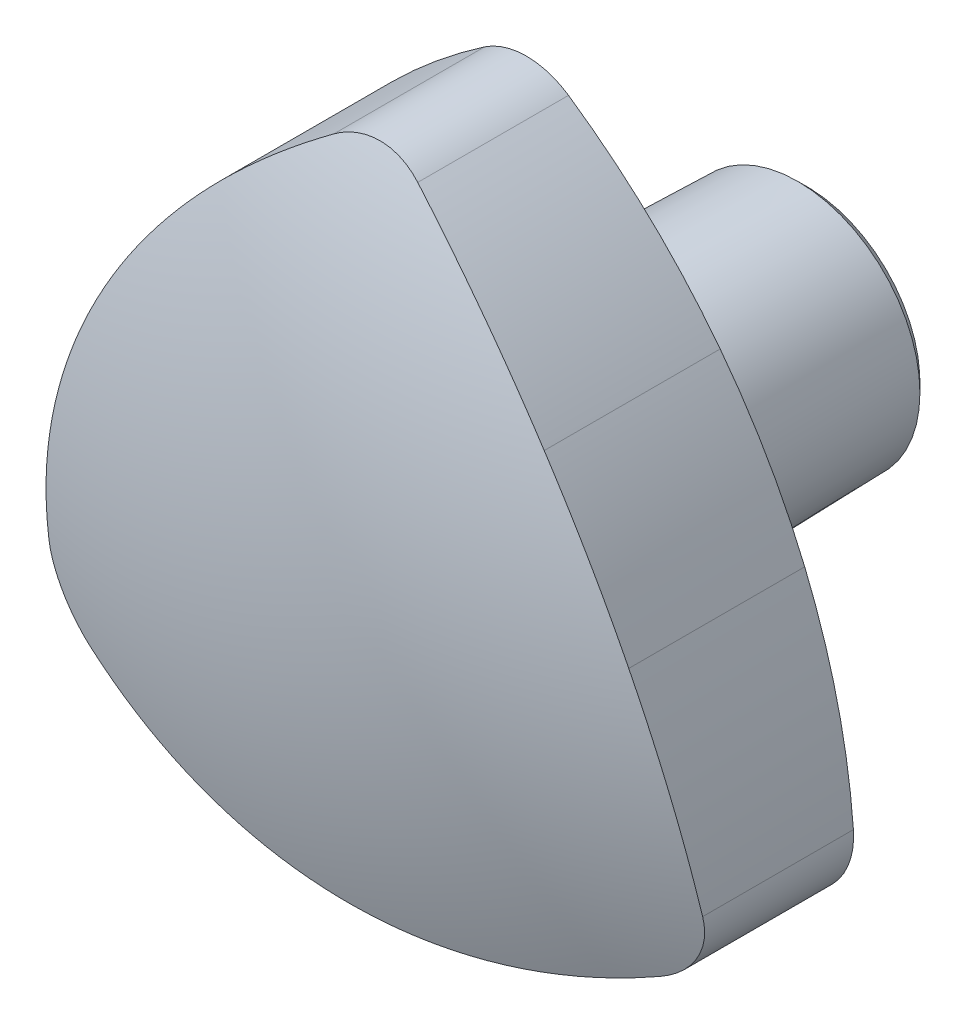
ISO-10303-21;
HEADER;
FILE_DESCRIPTION(('STEP AP214'),'2;1');
FILE_NAME('part.step','',(''),(''),'','','');
FILE_SCHEMA(('AUTOMOTIVE_DESIGN { 1 0 10303 214 1 1 1 1 }'));
ENDSEC;
DATA;
#1=APPLICATION_CONTEXT('core data for automotive mechanical design processes');
#2=APPLICATION_PROTOCOL_DEFINITION('international standard','automotive_design',2000,#1);
#3=PRODUCT_CONTEXT('',#1,'mechanical');
#4=PRODUCT('Part','Part','',(#3));
#5=PRODUCT_RELATED_PRODUCT_CATEGORY('part','',(#4));
#6=PRODUCT_DEFINITION_FORMATION('','',#4);
#7=PRODUCT_DEFINITION_CONTEXT('part definition',#1,'design');
#8=PRODUCT_DEFINITION('design','',#6,#7);
#9=PRODUCT_DEFINITION_SHAPE('','',#8);
#10=(LENGTH_UNIT() NAMED_UNIT(*) SI_UNIT(.MILLI.,.METRE.));
#11=(NAMED_UNIT(*) PLANE_ANGLE_UNIT() SI_UNIT($,.RADIAN.));
#12=(NAMED_UNIT(*) SI_UNIT($,.STERADIAN.) SOLID_ANGLE_UNIT());
#13=UNCERTAINTY_MEASURE_WITH_UNIT(LENGTH_MEASURE(1.E-05),#10,'distance_accuracy_value','');
#14=(GEOMETRIC_REPRESENTATION_CONTEXT(3) GLOBAL_UNCERTAINTY_ASSIGNED_CONTEXT((#13)) GLOBAL_UNIT_ASSIGNED_CONTEXT((#10,
#11,#12)) REPRESENTATION_CONTEXT('',''));
#15=CARTESIAN_POINT('',(0.,0.,0.));
#16=DIRECTION('',(0.,0.,1.));
#17=DIRECTION('',(1.,0.,0.));
#18=AXIS2_PLACEMENT_3D('',#15,#16,#17);
#19=CARTESIAN_POINT('',(0.,0.,18.));
#20=DIRECTION('',(0.,0.,1.));
#21=DIRECTION('',(-1.,0.,0.));
#22=AXIS2_PLACEMENT_3D('',#19,#20,#21);
#23=PLANE('',#22);
#24=CARTESIAN_POINT('',(0.,0.,18.));
#25=DIRECTION('',(0.,0.,1.));
#26=DIRECTION('',(-1.,0.,0.));
#27=AXIS2_PLACEMENT_3D('',#24,#25,#26);
#28=CIRCLE('',#27,5.);
#29=CARTESIAN_POINT('',(-4.99999999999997,0.,18.));
#30=VERTEX_POINT('',#29);
#31=EDGE_CURVE('E268',#30,#30,#28,.T.);
#32=ORIENTED_EDGE('',*,*,#31,.F.);
#33=EDGE_LOOP('',(#32));
#34=FACE_BOUND('',#33,.T.);
#35=ADVANCED_FACE('F14',(#34),#23,.F.);
#36=CARTESIAN_POINT('',(0.,0.,51.1168657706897));
#37=DIRECTION('',(0.,0.,1.));
#38=DIRECTION('',(-1.,0.,0.));
#39=AXIS2_PLACEMENT_3D('',#36,#37,#38);
#40=CYLINDRICAL_SURFACE('',#39,5.);
#41=CARTESIAN_POINT('',(0.,0.,0.));
#42=DIRECTION('',(0.,0.,1.));
#43=DIRECTION('',(-1.,0.,0.));
#44=AXIS2_PLACEMENT_3D('',#41,#42,#43);
#45=CIRCLE('',#44,5.);
#46=CARTESIAN_POINT('',(-4.99999999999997,0.,0.));
#47=VERTEX_POINT('',#46);
#48=EDGE_CURVE('E265',#47,#47,#45,.T.);
#49=ORIENTED_EDGE('',*,*,#48,.F.);
#50=EDGE_LOOP('',(#49));
#51=FACE_BOUND('',#50,.T.);
#52=ORIENTED_EDGE('',*,*,#31,.T.);
#53=EDGE_LOOP('',(#52));
#54=FACE_BOUND('',#53,.T.);
#55=ADVANCED_FACE('F346',(#51,#54),#40,.F.);
#56=CARTESIAN_POINT('',(9.22983245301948,0.,0.));
#57=DIRECTION('',(0.,0.,1.));
#58=DIRECTION('',(-1.,0.,0.));
#59=AXIS2_PLACEMENT_3D('',#56,#57,#58);
#60=PLANE('',#59);
#61=CARTESIAN_POINT('',(0.,0.,0.));
#62=DIRECTION('',(0.,0.,1.));
#63=DIRECTION('',(-1.,0.,0.));
#64=AXIS2_PLACEMENT_3D('',#61,#62,#63);
#65=CIRCLE('',#64,9.22983245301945);
#66=CARTESIAN_POINT('',(-9.22983245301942,0.,0.));
#67=VERTEX_POINT('',#66);
#68=EDGE_CURVE('E262',#67,#67,#65,.T.);
#69=ORIENTED_EDGE('',*,*,#68,.F.);
#70=EDGE_LOOP('',(#69));
#71=FACE_BOUND('',#70,.T.);
#72=ORIENTED_EDGE('',*,*,#48,.T.);
#73=EDGE_LOOP('',(#72));
#74=FACE_BOUND('',#73,.T.);
#75=ADVANCED_FACE('F352',(#71,#74),#60,.F.);
#76=CARTESIAN_POINT('',(0.,0.,0.));
#77=DIRECTION('',(0.,0.,1.));
#78=DIRECTION('',(-1.,0.,0.));
#79=AXIS2_PLACEMENT_3D('',#76,#77,#78);
#80=CONICAL_SURFACE('',#79,9.22983245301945,0.7853981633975);
#81=CARTESIAN_POINT('',(0.,0.,0.770167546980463));
#82=DIRECTION('',(0.,0.,1.));
#83=DIRECTION('',(-1.,0.,0.));
#84=AXIS2_PLACEMENT_3D('',#81,#82,#83);
#85=CIRCLE('',#84,10.);
#86=CARTESIAN_POINT('',(-9.99999999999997,0.,0.770167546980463));
#87=VERTEX_POINT('',#86);
#88=EDGE_CURVE('E259',#87,#87,#85,.T.);
#89=ORIENTED_EDGE('',*,*,#88,.F.);
#90=EDGE_LOOP('',(#89));
#91=FACE_BOUND('',#90,.T.);
#92=ORIENTED_EDGE('',*,*,#68,.T.);
#93=EDGE_LOOP('',(#92));
#94=FACE_BOUND('',#93,.T.);
#95=ADVANCED_FACE('F359',(#91,#94),#80,.T.);
#96=CARTESIAN_POINT('',(0.,0.,0.770167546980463));
#97=DIRECTION('',(0.,0.,1.));
#98=DIRECTION('',(-1.,0.,0.));
#99=AXIS2_PLACEMENT_3D('',#96,#97,#98);
#100=CONICAL_SURFACE('',#99,10.,0.0261799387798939);
#101=CARTESIAN_POINT('',(0.,0.,18.9302419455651));
#102=DIRECTION('',(0.,0.,1.));
#103=DIRECTION('',(-1.,0.,0.));
#104=AXIS2_PLACEMENT_3D('',#101,#102,#103);
#105=CIRCLE('',#104,10.4755382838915);
#106=CARTESIAN_POINT('',(-10.4755382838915,0.,18.9302419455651));
#107=VERTEX_POINT('',#106);
#108=EDGE_CURVE('E256',#107,#107,#105,.T.);
#109=ORIENTED_EDGE('',*,*,#108,.F.);
#110=EDGE_LOOP('',(#109));
#111=FACE_BOUND('',#110,.T.);
#112=ORIENTED_EDGE('',*,*,#88,.T.);
#113=EDGE_LOOP('',(#112));
#114=FACE_BOUND('',#113,.T.);
#115=ADVANCED_FACE('F363',(#111,#114),#100,.T.);
#116=CARTESIAN_POINT('',(0.,0.,18.8517111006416));
#117=DIRECTION('',(0.,0.,1.));
#118=DIRECTION('',(-1.,0.,0.));
#119=AXIS2_PLACEMENT_3D('',#116,#117,#118);
#120=TOROIDAL_SURFACE('',#119,13.4745102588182,3.);
#121=CARTESIAN_POINT('',(0.,0.,21.826045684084));
#122=DIRECTION('',(0.,0.,1.));
#123=DIRECTION('',(-1.,0.,0.));
#124=AXIS2_PLACEMENT_3D('',#121,#122,#123);
#125=CIRCLE('',#124,13.0829316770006);
#126=CARTESIAN_POINT('',(-13.0829316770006,0.,21.826045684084));
#127=VERTEX_POINT('',#126);
#128=EDGE_CURVE('E253',#127,#127,#125,.T.);
#129=ORIENTED_EDGE('',*,*,#128,.F.);
#130=EDGE_LOOP('',(#129));
#131=FACE_BOUND('',#130,.T.);
#132=ORIENTED_EDGE('',*,*,#108,.T.);
#133=EDGE_LOOP('',(#132));
#134=FACE_BOUND('',#133,.T.);
#135=ADVANCED_FACE('F367',(#131,#134),#120,.F.);
#136=CARTESIAN_POINT('',(0.,0.,21.826045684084));
#137=DIRECTION('',(0.,0.,1.));
#138=DIRECTION('',(-1.,0.,0.));
#139=AXIS2_PLACEMENT_3D('',#136,#137,#138);
#140=CONICAL_SURFACE('',#139,13.0829316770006,1.43989663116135);
#141=CARTESIAN_POINT('',(0.,0.,23.));
#142=DIRECTION('',(0.,0.,1.));
#143=DIRECTION('',(-1.,0.,0.));
#144=AXIS2_PLACEMENT_3D('',#141,#142,#143);
#145=CIRCLE('',#144,21.9999998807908);
#146=CARTESIAN_POINT('',(-21.9999998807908,0.,23.));
#147=VERTEX_POINT('',#146);
#148=EDGE_CURVE('E250',#147,#147,#145,.T.);
#149=ORIENTED_EDGE('',*,*,#148,.F.);
#150=EDGE_LOOP('',(#149));
#151=FACE_BOUND('',#150,.T.);
#152=ORIENTED_EDGE('',*,*,#128,.T.);
#153=EDGE_LOOP('',(#152));
#154=FACE_BOUND('',#153,.T.);
#155=ADVANCED_FACE('F370',(#151,#154),#140,.T.);
#156=CARTESIAN_POINT('',(21.9999998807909,0.,23.));
#157=DIRECTION('',(0.,0.,1.));
#158=DIRECTION('',(-1.,0.,0.));
#159=AXIS2_PLACEMENT_3D('',#156,#157,#158);
#160=PLANE('',#159);
#161=CARTESIAN_POINT('',(26.9432158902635,-15.5556718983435,23.));
#162=DIRECTION('',(0.,0.,1.));
#163=DIRECTION('',(-1.,0.,0.));
#164=AXIS2_PLACEMENT_3D('',#161,#162,#163);
#165=CIRCLE('',#164,53.877480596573);
#166=CARTESIAN_POINT('',(-15.8661888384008,17.1572885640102,23.));
#167=VERTEX_POINT('',#166);
#168=CARTESIAN_POINT('',(-3.44005613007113,28.9374702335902,23.));
#169=VERTEX_POINT('',#168);
#170=EDGE_CURVE('E23',#167,#169,#165,.F.);
#171=ORIENTED_EDGE('',*,*,#170,.T.);
#172=CARTESIAN_POINT('',(6.55585155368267E-08,23.8998066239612,23.));
#173=DIRECTION('',(0.,0.,1.));
#174=DIRECTION('',(-1.,0.,0.));
#175=AXIS2_PLACEMENT_3D('',#172,#173,#174);
#176=CIRCLE('',#175,6.1001673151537);
#177=CARTESIAN_POINT('',(3.44005610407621,28.9374703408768,23.0000000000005));
#178=VERTEX_POINT('',#177);
#179=EDGE_CURVE('E9',#169,#178,#176,.F.);
#180=ORIENTED_EDGE('',*,*,#179,.T.);
#181=CARTESIAN_POINT('',(-26.9432174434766,-15.5556719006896,23.));
#182=DIRECTION('',(0.,0.,1.));
#183=DIRECTION('',(-1.,0.,0.));
#184=AXIS2_PLACEMENT_3D('',#181,#182,#183);
#185=CIRCLE('',#184,53.8774815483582);
#186=CARTESIAN_POINT('',(15.8661886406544,17.1572883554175,23.));
#187=VERTEX_POINT('',#186);
#188=EDGE_CURVE('E271',#178,#187,#185,.F.);
#189=ORIENTED_EDGE('',*,*,#188,.T.);
#190=CARTESIAN_POINT('',(-26.7580741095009,-15.4487855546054,23.));
#191=DIRECTION('',(0.,0.,1.));
#192=DIRECTION('',(-1.,0.,0.));
#193=AXIS2_PLACEMENT_3D('',#190,#191,#192);
#194=CIRCLE('',#193,53.6654808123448);
#195=CARTESIAN_POINT('',(22.7917431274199,5.16187776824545,23.0000000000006));
#196=VERTEX_POINT('',#195);
#197=EDGE_CURVE('E114',#187,#196,#194,.F.);
#198=ORIENTED_EDGE('',*,*,#197,.T.);
#199=CARTESIAN_POINT('',(-26.9432174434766,-15.5556719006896,23.));
#200=DIRECTION('',(0.,0.,1.));
#201=DIRECTION('',(-1.,0.,0.));
#202=AXIS2_PLACEMENT_3D('',#199,#200,#201);
#203=CIRCLE('',#202,53.8774829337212);
#204=CARTESIAN_POINT('',(26.7806124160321,-11.4895591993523,23.0000000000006));
#205=VERTEX_POINT('',#204);
#206=EDGE_CURVE('E274',#196,#205,#203,.F.);
#207=ORIENTED_EDGE('',*,*,#206,.T.);
#208=CARTESIAN_POINT('',(20.6978478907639,-11.9499076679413,23.));
#209=DIRECTION('',(0.,0.,1.));
#210=DIRECTION('',(-1.,0.,0.));
#211=AXIS2_PLACEMENT_3D('',#208,#209,#210);
#212=CIRCLE('',#211,6.10015942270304);
#213=CARTESIAN_POINT('',(23.3405563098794,-17.4479106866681,23.));
#214=VERTEX_POINT('',#213);
#215=EDGE_CURVE('E277',#205,#214,#212,.F.);
#216=ORIENTED_EDGE('',*,*,#215,.T.);
#217=CARTESIAN_POINT('',(1.26951739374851E-07,31.1113463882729,23.));
#218=DIRECTION('',(0.,0.,1.));
#219=DIRECTION('',(-1.,0.,0.));
#220=AXIS2_PLACEMENT_3D('',#217,#218,#219);
#221=CIRCLE('',#220,53.8774814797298);
#222=CARTESIAN_POINT('',(6.92555394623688,-22.3191665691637,23.0000000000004));
#223=VERTEX_POINT('',#222);
#224=EDGE_CURVE('E280',#214,#223,#221,.F.);
#225=ORIENTED_EDGE('',*,*,#224,.T.);
#226=CARTESIAN_POINT('',(0.,30.8974794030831,23.));
#227=DIRECTION('',(0.,0.,1.));
#228=DIRECTION('',(-1.,0.,0.));
#229=AXIS2_PLACEMENT_3D('',#226,#227,#228);
#230=CIRCLE('',#229,53.665395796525);
#231=CARTESIAN_POINT('',(-6.92555394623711,-22.3191665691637,23.0000000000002));
#232=VERTEX_POINT('',#231);
#233=EDGE_CURVE('E283',#223,#232,#230,.F.);
#234=ORIENTED_EDGE('',*,*,#233,.T.);
#235=CARTESIAN_POINT('',(1.26951739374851E-07,31.1113463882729,23.));
#236=DIRECTION('',(0.,0.,1.));
#237=DIRECTION('',(-1.,0.,0.));
#238=AXIS2_PLACEMENT_3D('',#235,#236,#237);
#239=CIRCLE('',#238,53.8774815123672);
#240=CARTESIAN_POINT('',(-23.3405562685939,-17.4479106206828,23.));
#241=VERTEX_POINT('',#240);
#242=EDGE_CURVE('E286',#232,#241,#239,.F.);
#243=ORIENTED_EDGE('',*,*,#242,.T.);
#244=CARTESIAN_POINT('',(-20.6978458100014,-11.9499063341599,23.));
#245=DIRECTION('',(0.,0.,1.));
#246=DIRECTION('',(-1.,0.,0.));
#247=AXIS2_PLACEMENT_3D('',#244,#245,#246);
#248=CIRCLE('',#247,6.10016144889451);
#249=CARTESIAN_POINT('',(-26.7806124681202,-11.4895591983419,23.));
#250=VERTEX_POINT('',#249);
#251=EDGE_CURVE('E289',#241,#250,#248,.F.);
#252=ORIENTED_EDGE('',*,*,#251,.T.);
#253=CARTESIAN_POINT('',(26.9432158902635,-15.5556718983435,23.));
#254=DIRECTION('',(0.,0.,1.));
#255=DIRECTION('',(-1.,0.,0.));
#256=AXIS2_PLACEMENT_3D('',#253,#254,#255);
#257=CIRCLE('',#256,53.8774814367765);
#258=CARTESIAN_POINT('',(-22.791743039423,5.16187781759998,23.));
#259=VERTEX_POINT('',#258);
#260=EDGE_CURVE('E292',#250,#259,#257,.F.);
#261=ORIENTED_EDGE('',*,*,#260,.T.);
#262=CARTESIAN_POINT('',(26.7581635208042,-15.4488356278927,23.));
#263=DIRECTION('',(0.,0.,1.));
#264=DIRECTION('',(-1.,0.,0.));
#265=AXIS2_PLACEMENT_3D('',#262,#263,#264);
#266=CIRCLE('',#265,53.6655825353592);
#267=EDGE_CURVE('E295',#259,#167,#266,.F.);
#268=ORIENTED_EDGE('',*,*,#267,.T.);
#269=EDGE_LOOP('',(#171,#180,#189,#198,#207,#216,#225,#234,#243,#252,#261,#268));
#270=FACE_BOUND('',#269,.T.);
#271=ORIENTED_EDGE('',*,*,#148,.T.);
#272=EDGE_LOOP('',(#271));
#273=FACE_BOUND('',#272,.T.);
#274=ADVANCED_FACE('F241',(#270,#273),#160,.F.);
#275=CARTESIAN_POINT('',(6.55584384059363E-08,23.8998066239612,41.));
#276=DIRECTION('',(0.,0.,-1.));
#277=DIRECTION('',(0.,1.,0.));
#278=AXIS2_PLACEMENT_3D('',#275,#276,#277);
#279=CYLINDRICAL_SURFACE('',#278,6.1001673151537);
#280=DIRECTION('',(0.,0.,-1.));
#281=VECTOR('',#280,1.);
#282=CARTESIAN_POINT('',(3.44005610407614,28.9374703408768,41.));
#283=LINE('',#282,#281);
#284=CARTESIAN_POINT('',(3.44005610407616,28.9374703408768,35.3518405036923));
#285=VERTEX_POINT('',#284);
#286=EDGE_CURVE('E30',#285,#178,#283,.T.);
#287=ORIENTED_EDGE('',*,*,#286,.T.);
#288=ORIENTED_EDGE('',*,*,#179,.F.);
#289=DIRECTION('',(0.,0.,-1.));
#290=VECTOR('',#289,1.);
#291=CARTESIAN_POINT('',(-3.44005613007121,28.9374702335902,41.));
#292=LINE('',#291,#290);
#293=CARTESIAN_POINT('',(-3.44005613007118,28.9374702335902,35.3518405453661));
#294=VERTEX_POINT('',#293);
#295=EDGE_CURVE('E107',#294,#169,#292,.T.);
#296=ORIENTED_EDGE('',*,*,#295,.F.);
#297=CARTESIAN_POINT('',(3.44025610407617,28.9373337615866,35.3518856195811));
#298=CARTESIAN_POINT('',(3.30532578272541,29.0295035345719,35.3214393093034));
#299=CARTESIAN_POINT('',(3.16639778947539,29.1164084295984,35.2927131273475));
#300=CARTESIAN_POINT('',(2.88144512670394,29.2790418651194,35.2389269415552));
#301=CARTESIAN_POINT('',(2.73541944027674,29.3547687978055,35.2138674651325));
#302=CARTESIAN_POINT('',(2.4371499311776,29.4944006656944,35.1676402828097));
#303=CARTESIAN_POINT('',(2.28490365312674,29.5583008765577,35.1464741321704));
#304=CARTESIAN_POINT('',(1.97528414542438,29.6736772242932,35.1082435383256));
#305=CARTESIAN_POINT('',(1.81791126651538,29.7251542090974,35.0911788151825));
#306=CARTESIAN_POINT('',(1.49889865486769,29.8152826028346,35.0612930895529));
#307=CARTESIAN_POINT('',(1.33725327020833,29.8539159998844,35.0484780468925));
#308=CARTESIAN_POINT('',(1.01106685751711,29.9178966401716,35.02725136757));
#309=CARTESIAN_POINT('',(0.846525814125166,29.94324381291,35.0188397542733));
#310=CARTESIAN_POINT('',(0.515875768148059,29.9803962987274,35.0065094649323));
#311=CARTESIAN_POINT('',(0.349767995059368,29.9922114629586,35.0025875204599));
#312=CARTESIAN_POINT('',(0.0171022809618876,30.0022191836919,34.999265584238));
#313=CARTESIAN_POINT('',(-0.149455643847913,30.000412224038,34.9998654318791));
#314=CARTESIAN_POINT('',(-0.478705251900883,29.9833541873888,35.0055274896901));
#315=CARTESIAN_POINT('',(-0.641411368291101,29.9683529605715,35.010506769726));
#316=CARTESIAN_POINT('',(-0.964907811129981,29.925387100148,35.024765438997));
#317=CARTESIAN_POINT('',(-1.12569816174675,29.897422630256,35.0340447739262));
#318=CARTESIAN_POINT('',(-1.44429315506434,29.828770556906,35.0568188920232));
#319=CARTESIAN_POINT('',(-1.60209684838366,29.7880789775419,35.0703149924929));
#320=CARTESIAN_POINT('',(-1.91352420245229,29.6943666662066,35.1013849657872));
#321=CARTESIAN_POINT('',(-2.06714863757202,29.6413482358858,35.1189580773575));
#322=CARTESIAN_POINT('',(-2.43446080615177,29.4979527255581,35.1664656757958));
#323=CARTESIAN_POINT('',(-2.64549667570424,29.4013230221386,35.1984634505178));
#324=CARTESIAN_POINT('',(-2.9517191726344,29.2395378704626,35.251992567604));
#325=CARTESIAN_POINT('',(-3.05199214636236,29.1828569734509,35.2707397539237));
#326=CARTESIAN_POINT('',(-3.24890436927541,29.0640940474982,35.3100037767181));
#327=CARTESIAN_POINT('',(-3.3455442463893,29.002012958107,35.3305203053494));
#328=CARTESIAN_POINT('',(-3.44025613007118,28.9373336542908,35.3518856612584));
#329=B_SPLINE_CURVE_WITH_KNOTS('',3,(#297,#298,#299,#300,#301,#302,#303,#304,#305,#306,#307,
#308,#309,#310,#311,#312,#313,#314,#315,#316,#317,#318,#319,#320,#321,#322,#323,#324,#325,#326,
#327,#328),.UNSPECIFIED.,.F.,.F.,(4,2,2,2,2,2,2,2,2,2,2,2,2,2,2,4),(0.,0.498531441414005,
0.997134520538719,1.49593634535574,1.99470411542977,2.49416843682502,2.99363540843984,
3.49273854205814,3.99182394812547,4.48165722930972,4.97148432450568,5.4614645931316,
5.95135344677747,6.65239601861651,7.00233428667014,7.35221179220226),.UNSPECIFIED.);
#330=EDGE_CURVE('E244',#285,#294,#329,.T.);
#331=ORIENTED_EDGE('',*,*,#330,.F.);
#332=EDGE_LOOP('',(#287,#288,#296,#331));
#333=FACE_BOUND('',#332,.T.);
#334=ADVANCED_FACE('F236',(#333),#279,.T.);
#335=CARTESIAN_POINT('',(26.9432158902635,-15.5556718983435,41.));
#336=DIRECTION('',(0.,0.,-1.));
#337=DIRECTION('',(0.,1.,0.));
#338=AXIS2_PLACEMENT_3D('',#335,#336,#337);
#339=CYLINDRICAL_SURFACE('',#338,53.877480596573);
#340=ORIENTED_EDGE('',*,*,#295,.T.);
#341=ORIENTED_EDGE('',*,*,#170,.F.);
#342=DIRECTION('',(0.,0.,-1.));
#343=VECTOR('',#342,1.);
#344=CARTESIAN_POINT('',(-15.8661888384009,17.1572885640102,41.));
#345=LINE('',#344,#343);
#346=CARTESIAN_POINT('',(-15.8661888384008,17.1572885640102,37.4170108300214));
#347=VERTEX_POINT('',#346);
#348=EDGE_CURVE('E303',#347,#167,#345,.T.);
#349=ORIENTED_EDGE('',*,*,#348,.F.);
#350=CARTESIAN_POINT('',(-3.43985613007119,28.9376068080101,35.3517954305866));
#351=CARTESIAN_POINT('',(-4.02827278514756,28.5358110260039,35.4845282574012));
#352=CARTESIAN_POINT('',(-4.60958080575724,28.1217235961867,35.611610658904));
#353=CARTESIAN_POINT('',(-5.75681837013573,27.2695647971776,35.8543404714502));
#354=CARTESIAN_POINT('',(-6.32274760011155,26.8314929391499,35.9699876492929));
#355=CARTESIAN_POINT('',(-7.43397792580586,25.9352590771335,36.1889067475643));
#356=CARTESIAN_POINT('',(-7.97939930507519,25.4772667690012,36.2922627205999));
#357=CARTESIAN_POINT('',(-9.05280071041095,24.5389391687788,36.4874474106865));
#358=CARTESIAN_POINT('',(-9.58078089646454,24.0586040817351,36.5792762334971));
#359=CARTESIAN_POINT('',(-10.6182409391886,23.0763122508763,36.7513016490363));
#360=CARTESIAN_POINT('',(-11.1277200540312,22.5743546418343,36.8314977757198));
#361=CARTESIAN_POINT('',(-12.1271094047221,21.5496488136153,36.9801567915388));
#362=CARTESIAN_POINT('',(-12.6170196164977,21.0269005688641,37.0486196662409));
#363=CARTESIAN_POINT('',(-13.5797801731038,19.9575787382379,37.1741861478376));
#364=CARTESIAN_POINT('',(-14.0524790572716,19.4108585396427,37.2312027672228));
#365=CARTESIAN_POINT('',(-14.9760362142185,18.2981668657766,37.333176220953));
#366=CARTESIAN_POINT('',(-15.4268940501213,17.7321950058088,37.3781328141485));
#367=CARTESIAN_POINT('',(-15.8663416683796,17.1570885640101,37.4170243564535));
#368=B_SPLINE_CURVE_WITH_KNOTS('',3,(#350,#351,#352,#353,#354,#355,#356,#357,#358,#359,#360,
#361,#362,#363,#364,#365,#366,#367),.UNSPECIFIED.,.F.,.F.,(4,2,2,2,2,2,2,2,4),(0.,
2.17416276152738,4.34836985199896,6.50673044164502,8.66507122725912,10.8234984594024,
12.9819283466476,15.1561874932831,17.3304901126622),.UNSPECIFIED.);
#369=EDGE_CURVE('E221',#294,#347,#368,.T.);
#370=ORIENTED_EDGE('',*,*,#369,.F.);
#371=EDGE_LOOP('',(#340,#341,#349,#370));
#372=FACE_BOUND('',#371,.T.);
#373=ADVANCED_FACE('F231',(#372),#339,.T.);
#374=CARTESIAN_POINT('',(26.7581635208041,-15.4488356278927,41.));
#375=DIRECTION('',(0.,0.,-1.));
#376=DIRECTION('',(0.,1.,0.));
#377=AXIS2_PLACEMENT_3D('',#374,#375,#376);
#378=CYLINDRICAL_SURFACE('',#377,53.6655825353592);
#379=ORIENTED_EDGE('',*,*,#348,.T.);
#380=ORIENTED_EDGE('',*,*,#267,.F.);
#381=DIRECTION('',(0.,0.,-1.));
#382=VECTOR('',#381,1.);
#383=CARTESIAN_POINT('',(-22.7917430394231,5.16187781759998,41.));
#384=LINE('',#383,#382);
#385=CARTESIAN_POINT('',(-22.7917430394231,5.16187781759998,37.4170105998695));
#386=VERTEX_POINT('',#385);
#387=EDGE_CURVE('E308',#386,#259,#384,.T.);
#388=ORIENTED_EDGE('',*,*,#387,.F.);
#389=CARTESIAN_POINT('',(-15.8660358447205,17.1574885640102,37.4169973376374));
#390=CARTESIAN_POINT('',(-16.2182252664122,16.6970963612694,37.4480567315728));
#391=CARTESIAN_POINT('',(-16.563051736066,16.2308648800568,37.4752390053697));
#392=CARTESIAN_POINT('',(-17.2375904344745,15.2872141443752,37.5218323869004));
#393=CARTESIAN_POINT('',(-17.5673026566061,14.8097948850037,37.5412434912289));
#394=CARTESIAN_POINT('',(-18.5299448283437,13.3663507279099,37.5876384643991));
#395=CARTESIAN_POINT('',(-19.1399316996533,12.384495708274,37.6030965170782));
#396=CARTESIAN_POINT('',(-20.2952372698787,10.3834494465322,37.6030967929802));
#397=CARTESIAN_POINT('',(-20.8405559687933,9.36425820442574,37.5876390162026));
#398=CARTESIAN_POINT('',(-21.6092953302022,7.80886410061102,37.5412444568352));
#399=CARTESIAN_POINT('',(-21.8578968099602,7.28461548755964,37.5218334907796));
#400=CARTESIAN_POINT('',(-22.3378537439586,6.22862281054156,37.4752403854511));
#401=CARTESIAN_POINT('',(-22.5692092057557,5.69687874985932,37.4480582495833));
#402=CARTESIAN_POINT('',(-22.7918262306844,5.16167781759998,37.416998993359));
#403=B_SPLINE_CURVE_WITH_KNOTS('',3,(#389,#390,#391,#392,#393,#394,#395,#396,#397,#398,#399,
#400,#401,#402),.UNSPECIFIED.,.F.,.F.,(4,2,2,2,2,2,4),(0.,1.74127934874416,3.48255946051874,
6.94759570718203,10.4126319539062,12.1539120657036,13.895191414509),.UNSPECIFIED.);
#404=EDGE_CURVE('E214',#347,#386,#403,.T.);
#405=ORIENTED_EDGE('',*,*,#404,.F.);
#406=EDGE_LOOP('',(#379,#380,#388,#405));
#407=FACE_BOUND('',#406,.T.);
#408=ADVANCED_FACE('F228',(#407),#378,.T.);
#409=CARTESIAN_POINT('',(26.9432158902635,-15.5556718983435,41.));
#410=DIRECTION('',(0.,0.,-1.));
#411=DIRECTION('',(0.,1.,0.));
#412=AXIS2_PLACEMENT_3D('',#409,#410,#411);
#413=CYLINDRICAL_SURFACE('',#412,53.8774814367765);
#414=ORIENTED_EDGE('',*,*,#387,.T.);
#415=ORIENTED_EDGE('',*,*,#260,.F.);
#416=DIRECTION('',(0.,0.,-1.));
#417=VECTOR('',#416,1.);
#418=CARTESIAN_POINT('',(-26.7806124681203,-11.4895591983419,41.));
#419=LINE('',#418,#417);
#420=CARTESIAN_POINT('',(-26.7806124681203,-11.4895591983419,35.3518405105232));
#421=VERTEX_POINT('',#420);
#422=EDGE_CURVE('E310',#421,#250,#419,.T.);
#423=ORIENTED_EDGE('',*,*,#422,.F.);
#424=CARTESIAN_POINT('',(-22.7916597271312,5.16207781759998,37.4170222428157));
#425=CARTESIAN_POINT('',(-23.0699909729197,4.4939546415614,37.3781306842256));
#426=CARTESIAN_POINT('',(-23.3347064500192,3.82051727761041,37.3331741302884));
#427=CARTESIAN_POINT('',(-23.8365441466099,2.46435339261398,37.2312008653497));
#428=CARTESIAN_POINT('',(-24.0736669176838,1.78162705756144,37.1741843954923));
#429=CARTESIAN_POINT('',(-24.5183440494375,0.413197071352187,37.0486183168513));
#430=CARTESIAN_POINT('',(-24.7261011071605,-0.272448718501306,36.9801556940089));
#431=CARTESIAN_POINT('',(-25.1138257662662,-1.65029209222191,36.831497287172));
#432=CARTESIAN_POINT('',(-25.2937934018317,-2.34248966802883,36.7513015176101));
#433=CARTESIAN_POINT('',(-25.6257516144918,-3.7320961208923,36.5792769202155));
#434=CARTESIAN_POINT('',(-25.7777433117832,-4.42950478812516,36.487448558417));
#435=CARTESIAN_POINT('',(-26.053657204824,-5.82825518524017,36.2922648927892));
#436=CARTESIAN_POINT('',(-26.1775791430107,-6.52959695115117,36.188909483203));
#437=CARTESIAN_POINT('',(-26.3981248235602,-7.9400611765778,35.9699916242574));
#438=CARTESIAN_POINT('',(-26.4945414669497,-8.64920295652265,35.8543451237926));
#439=CARTESIAN_POINT('',(-26.6589139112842,-10.0688127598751,35.6116167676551));
#440=CARTESIAN_POINT('',(-26.7268702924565,-10.7792807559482,35.4845351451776));
#441=CARTESIAN_POINT('',(-26.780627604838,-11.4897591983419,35.3518031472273));
#442=B_SPLINE_CURVE_WITH_KNOTS('',3,(#424,#425,#426,#427,#428,#429,#430,#431,#432,#433,#434,
#435,#436,#437,#438,#439,#440,#441),.UNSPECIFIED.,.F.,.F.,(4,2,2,2,2,2,2,2,4),(0.,
2.17429275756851,4.34854204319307,6.50696228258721,8.66537986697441,10.8237110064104,
12.9820619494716,15.1562591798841,17.3304120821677),.UNSPECIFIED.);
#443=EDGE_CURVE('E207',#386,#421,#442,.T.);
#444=ORIENTED_EDGE('',*,*,#443,.F.);
#445=EDGE_LOOP('',(#414,#415,#423,#444));
#446=FACE_BOUND('',#445,.T.);
#447=ADVANCED_FACE('F196',(#446),#413,.T.);
#448=CARTESIAN_POINT('',(-20.6978458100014,-11.9499063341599,41.));
#449=DIRECTION('',(0.,0.,-1.));
#450=DIRECTION('',(0.,1.,0.));
#451=AXIS2_PLACEMENT_3D('',#448,#449,#450);
#452=CYLINDRICAL_SURFACE('',#451,6.10016144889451);
#453=ORIENTED_EDGE('',*,*,#422,.T.);
#454=ORIENTED_EDGE('',*,*,#251,.F.);
#455=DIRECTION('',(0.,0.,-1.));
#456=VECTOR('',#455,1.);
#457=CARTESIAN_POINT('',(-23.340556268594,-17.4479106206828,41.));
#458=LINE('',#457,#456);
#459=CARTESIAN_POINT('',(-23.340556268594,-17.4479106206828,35.3518406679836));
#460=VERTEX_POINT('',#459);
#461=EDGE_CURVE('E315',#460,#241,#458,.T.);
#462=ORIENTED_EDGE('',*,*,#461,.F.);
#463=CARTESIAN_POINT('',(-26.7805973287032,-11.4893591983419,35.3518778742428));
#464=CARTESIAN_POINT('',(-26.7929524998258,-11.6522970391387,35.3214318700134));
#465=CARTESIAN_POINT('',(-26.7987493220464,-11.8160644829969,35.2927060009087));
#466=CARTESIAN_POINT('',(-26.7971156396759,-12.1441570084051,35.2389204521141));
#467=CARTESIAN_POINT('',(-26.7896832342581,-12.3084821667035,35.2138612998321));
#468=CARTESIAN_POINT('',(-26.7614712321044,-12.6366064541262,35.1676347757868));
#469=CARTESIAN_POINT('',(-26.7406863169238,-12.8004053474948,35.1464689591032));
#470=CARTESIAN_POINT('',(-26.6857934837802,-13.1262310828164,35.1082390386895));
#471=CARTESIAN_POINT('',(-26.6516864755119,-13.2882580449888,35.091174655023));
#472=CARTESIAN_POINT('',(-26.5702318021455,-13.6095943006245,35.0612896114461));
#473=CARTESIAN_POINT('',(-26.5228657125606,-13.768899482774,35.0484749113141));
#474=CARTESIAN_POINT('',(-26.4151796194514,-14.0833743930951,35.0272489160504));
#475=CARTESIAN_POINT('',(-26.3548595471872,-14.238544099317,35.0188376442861));
#476=CARTESIAN_POINT('',(-26.221707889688,-14.5434704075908,35.0065080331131));
#477=CARTESIAN_POINT('',(-26.1488854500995,-14.6932308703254,35.0025864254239));
#478=CARTESIAN_POINT('',(-25.9912180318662,-14.9863302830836,34.9992651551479));
#479=CARTESIAN_POINT('',(-25.9063734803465,-15.1296694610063,34.9998653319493));
#480=CARTESIAN_POINT('',(-25.7269746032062,-15.4062775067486,35.0055280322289));
#481=CARTESIAN_POINT('',(-25.6326294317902,-15.5396837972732,35.010507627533));
#482=CARTESIAN_POINT('',(-25.4336704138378,-15.7983554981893,35.0247669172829));
#483=CARTESIAN_POINT('',(-25.3290566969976,-15.9236210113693,35.0340465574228));
#484=CARTESIAN_POINT('',(-25.1103036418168,-16.1652047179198,35.0568212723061));
#485=CARTESIAN_POINT('',(-24.9961613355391,-16.2815201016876,35.070317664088));
#486=CARTESIAN_POINT('',(-24.7592894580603,-16.5043662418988,35.1013882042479));
#487=CARTESIAN_POINT('',(-24.6365614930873,-16.610898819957,35.118961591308));
#488=CARTESIAN_POINT('',(-24.3287269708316,-16.8572952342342,35.1664688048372));
#489=CARTESIAN_POINT('',(-24.1395320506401,-16.9917369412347,35.1984656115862));
#490=CARTESIAN_POINT('',(-23.8463216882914,-17.176033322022,35.2519928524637));
#491=CARTESIAN_POINT('',(-23.7471018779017,-17.2345295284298,35.2707393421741));
#492=CARTESIAN_POINT('',(-23.5458018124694,-17.3456749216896,35.3100018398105));
#493=CARTESIAN_POINT('',(-23.443722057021,-17.3983251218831,35.3305175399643));
#494=CARTESIAN_POINT('',(-23.3403562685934,-17.4480067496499,35.3518820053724));
#495=B_SPLINE_CURVE_WITH_KNOTS('',3,(#463,#464,#465,#466,#467,#468,#469,#470,#471,#472,#473,
#474,#475,#476,#477,#478,#479,#480,#481,#482,#483,#484,#485,#486,#487,#488,#489,#490,#491,#492,
#493,#494),.UNSPECIFIED.,.F.,.F.,(4,2,2,2,2,2,2,2,2,2,2,2,2,2,2,4),(0.,0.498530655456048,
0.997132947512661,1.49593396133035,1.99470092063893,2.49416442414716,2.99363057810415,
3.49273291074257,3.99181751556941,4.48165020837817,4.97147671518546,5.46145636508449,
5.95134459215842,6.65236043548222,7.00228532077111,7.35214945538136),.UNSPECIFIED.);
#496=EDGE_CURVE('E200',#421,#460,#495,.T.);
#497=ORIENTED_EDGE('',*,*,#496,.F.);
#498=EDGE_LOOP('',(#453,#454,#462,#497));
#499=FACE_BOUND('',#498,.T.);
#500=ADVANCED_FACE('F191',(#499),#452,.T.);
#501=CARTESIAN_POINT('',(1.26951662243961E-07,31.1113463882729,41.));
#502=DIRECTION('',(0.,0.,-1.));
#503=DIRECTION('',(0.,1.,0.));
#504=AXIS2_PLACEMENT_3D('',#501,#502,#503);
#505=CYLINDRICAL_SURFACE('',#504,53.8774815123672);
#506=ORIENTED_EDGE('',*,*,#461,.T.);
#507=ORIENTED_EDGE('',*,*,#242,.F.);
#508=DIRECTION('',(0.,0.,-1.));
#509=VECTOR('',#508,1.);
#510=CARTESIAN_POINT('',(-6.92555394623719,-22.3191665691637,41.));
#511=LINE('',#510,#509);
#512=CARTESIAN_POINT('',(-6.92555394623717,-22.3191665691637,37.4170108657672));
#513=VERTEX_POINT('',#512);
#514=EDGE_CURVE('E318',#513,#232,#511,.T.);
#515=ORIENTED_EDGE('',*,*,#514,.F.);
#516=CARTESIAN_POINT('',(-23.3407562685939,-17.4478144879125,35.351799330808));
#517=CARTESIAN_POINT('',(-22.6985851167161,-17.7564988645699,35.4845314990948));
#518=CARTESIAN_POINT('',(-22.0493234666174,-18.0528812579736,35.6116132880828));
#519=CARTESIAN_POINT('',(-20.7377188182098,-18.6203361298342,35.8543419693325));
#520=CARTESIAN_POINT('',(-20.0753755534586,-18.8914080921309,35.9699886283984));
#521=CARTESIAN_POINT('',(-18.7436045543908,-19.4056426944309,36.1889067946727));
#522=CARTESIAN_POINT('',(-18.0742636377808,-19.6489943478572,36.292262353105));
#523=CARTESIAN_POINT('',(-16.7249529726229,-20.1094217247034,36.4874463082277));
#524=CARTESIAN_POINT('',(-16.0449833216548,-20.3264976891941,36.5792748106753));
#525=CARTESIAN_POINT('',(-14.6755693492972,-20.7338172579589,36.7512996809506));
#526=CARTESIAN_POINT('',(-13.9861246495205,-20.9240597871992,36.8314955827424));
#527=CARTESIAN_POINT('',(-12.5990145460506,-21.277202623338,36.9801542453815));
#528=CARTESIAN_POINT('',(-11.9013491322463,-21.4401028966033,37.048616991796));
#529=CARTESIAN_POINT('',(-10.4939149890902,-21.7392167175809,37.1741833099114));
#530=CARTESIAN_POINT('',(-9.78409502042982,-21.8752257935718,37.2311998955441));
#531=CARTESIAN_POINT('',(-8.35870331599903,-22.1187040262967,37.3331733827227));
#532=CARTESIAN_POINT('',(-7.64313146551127,-22.2261726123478,37.3781300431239));
#533=CARTESIAN_POINT('',(-6.92535394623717,-22.319192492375,37.4170217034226));
#534=B_SPLINE_CURVE_WITH_KNOTS('',3,(#516,#517,#518,#519,#520,#521,#522,#523,#524,#525,#526,
#527,#528,#529,#530,#531,#532,#533),.UNSPECIFIED.,.F.,.F.,(4,2,2,2,2,2,2,2,4),(0.,
2.17415375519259,4.3483518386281,6.50670361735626,8.66503559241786,10.8234540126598,
12.9818750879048,15.1561252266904,17.3304188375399),.UNSPECIFIED.);
#535=EDGE_CURVE('E176',#460,#513,#534,.T.);
#536=ORIENTED_EDGE('',*,*,#535,.F.);
#537=EDGE_LOOP('',(#506,#507,#515,#536));
#538=FACE_BOUND('',#537,.T.);
#539=ADVANCED_FACE('F186',(#538),#505,.T.);
#540=CARTESIAN_POINT('',(-1.75687027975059E-13,30.8974794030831,41.));
#541=DIRECTION('',(0.,0.,-1.));
#542=DIRECTION('',(0.,1.,0.));
#543=AXIS2_PLACEMENT_3D('',#540,#541,#542);
#544=CYLINDRICAL_SURFACE('',#543,53.665395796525);
#545=ORIENTED_EDGE('',*,*,#514,.T.);
#546=ORIENTED_EDGE('',*,*,#233,.F.);
#547=DIRECTION('',(0.,0.,-1.));
#548=VECTOR('',#547,1.);
#549=CARTESIAN_POINT('',(6.9255539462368,-22.3191665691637,41.));
#550=LINE('',#549,#548);
#551=CARTESIAN_POINT('',(6.92555394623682,-22.3191665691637,37.4170108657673));
#552=VERTEX_POINT('',#551);
#553=EDGE_CURVE('E321',#552,#223,#550,.T.);
#554=ORIENTED_EDGE('',*,*,#553,.F.);
#555=CARTESIAN_POINT('',(-6.92575394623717,-22.3191405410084,37.4170000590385));
#556=CARTESIAN_POINT('',(-6.35095051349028,-22.3939487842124,37.448059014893));
#557=CARTESIAN_POINT('',(-5.77477160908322,-22.4594609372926,37.4752408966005));
#558=CARTESIAN_POINT('',(-4.62028205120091,-22.5718021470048,37.5218335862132));
#559=CARTESIAN_POINT('',(-4.04197139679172,-22.6186311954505,37.5412443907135));
#560=CARTESIAN_POINT('',(-2.3105989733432,-22.7305804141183,37.5876386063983));
#561=CARTESIAN_POINT('',(-1.15529948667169,-22.7679163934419,37.6030963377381));
#562=CARTESIAN_POINT('',(1.15529948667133,-22.7679163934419,37.6030963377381));
#563=CARTESIAN_POINT('',(2.31059897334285,-22.7305804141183,37.5876386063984));
#564=CARTESIAN_POINT('',(4.04197139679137,-22.6186311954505,37.5412443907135));
#565=CARTESIAN_POINT('',(4.62028205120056,-22.5718021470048,37.5218335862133));
#566=CARTESIAN_POINT('',(5.77477160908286,-22.4594609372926,37.4752408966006));
#567=CARTESIAN_POINT('',(6.35095051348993,-22.3939487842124,37.4480590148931));
#568=CARTESIAN_POINT('',(6.92575394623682,-22.3191405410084,37.4170000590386));
#569=B_SPLINE_CURVE_WITH_KNOTS('',3,(#555,#556,#557,#558,#559,#560,#561,#562,#563,#564,#565,
#566,#567,#568),.UNSPECIFIED.,.F.,.F.,(4,2,2,2,2,2,4),(0.,1.74127124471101,3.48254325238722,
6.94756344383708,10.4125836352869,12.1538556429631,13.8951268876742),.UNSPECIFIED.);
#570=EDGE_CURVE('E169',#513,#552,#569,.T.);
#571=ORIENTED_EDGE('',*,*,#570,.F.);
#572=EDGE_LOOP('',(#545,#546,#554,#571));
#573=FACE_BOUND('',#572,.T.);
#574=ADVANCED_FACE('F183',(#573),#544,.T.);
#575=CARTESIAN_POINT('',(1.26951662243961E-07,31.1113463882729,41.));
#576=DIRECTION('',(0.,0.,-1.));
#577=DIRECTION('',(0.,1.,0.));
#578=AXIS2_PLACEMENT_3D('',#575,#576,#577);
#579=CYLINDRICAL_SURFACE('',#578,53.8774814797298);
#580=ORIENTED_EDGE('',*,*,#553,.T.);
#581=ORIENTED_EDGE('',*,*,#224,.F.);
#582=DIRECTION('',(0.,0.,-1.));
#583=VECTOR('',#582,1.);
#584=CARTESIAN_POINT('',(23.3405563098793,-17.4479106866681,41.));
#585=LINE('',#584,#583);
#586=CARTESIAN_POINT('',(23.3405563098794,-17.4479106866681,35.3518406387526));
#587=VERTEX_POINT('',#586);
#588=EDGE_CURVE('E324',#587,#214,#585,.T.);
#589=ORIENTED_EDGE('',*,*,#588,.F.);
#590=CARTESIAN_POINT('',(6.92535394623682,-22.3191924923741,37.417021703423));
#591=CARTESIAN_POINT('',(7.64313146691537,-22.2261726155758,37.3781300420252));
#592=CARTESIAN_POINT('',(8.35870331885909,-22.1187040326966,37.333173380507));
#593=CARTESIAN_POINT('',(9.78409502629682,-21.8752258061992,37.2311998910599));
#594=CARTESIAN_POINT('',(10.4939149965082,-21.7392167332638,37.1741833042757));
#595=CARTESIAN_POINT('',(11.9013491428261,-21.4401029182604,37.0486169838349));
#596=CARTESIAN_POINT('',(12.5990145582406,-21.2772026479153,36.9801542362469));
#597=CARTESIAN_POINT('',(13.9861246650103,-20.9240598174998,36.8314955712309));
#598=CARTESIAN_POINT('',(14.6755693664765,-20.7338172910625,36.7512996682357));
#599=CARTESIAN_POINT('',(16.0449833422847,-20.3264977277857,36.5792747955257));
#600=CARTESIAN_POINT('',(16.7249529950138,-20.10942176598,36.4874462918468));
#601=CARTESIAN_POINT('',(18.0742636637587,-19.648994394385,36.2922623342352));
#602=CARTESIAN_POINT('',(18.7436045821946,-19.405642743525,36.1889067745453));
#603=CARTESIAN_POINT('',(20.0753755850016,-18.8914081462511,35.9699886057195));
#604=CARTESIAN_POINT('',(20.737718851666,-18.6203361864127,35.8543419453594));
#605=CARTESIAN_POINT('',(22.0493235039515,-18.052881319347,35.6116132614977));
#606=CARTESIAN_POINT('',(22.6985851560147,-17.7564989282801,35.484531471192));
#607=CARTESIAN_POINT('',(23.3407563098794,-17.4478145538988,35.3517993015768));
#608=B_SPLINE_CURVE_WITH_KNOTS('',3,(#590,#591,#592,#593,#594,#595,#596,#597,#598,#599,#600,
#601,#602,#603,#604,#605,#606,#607),.UNSPECIFIED.,.F.,.F.,(4,2,2,2,2,2,2,2,4),(0.,
2.17429361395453,4.34854375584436,6.50696483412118,8.66538325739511,10.823715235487,
12.9820670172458,15.1562651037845,17.3304188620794),.UNSPECIFIED.);
#609=EDGE_CURVE('E162',#552,#587,#608,.T.);
#610=ORIENTED_EDGE('',*,*,#609,.F.);
#611=EDGE_LOOP('',(#580,#581,#589,#610));
#612=FACE_BOUND('',#611,.T.);
#613=ADVANCED_FACE('F153',(#612),#579,.T.);
#614=CARTESIAN_POINT('',(20.6978478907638,-11.9499076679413,41.));
#615=DIRECTION('',(0.,0.,-1.));
#616=DIRECTION('',(0.,1.,0.));
#617=AXIS2_PLACEMENT_3D('',#614,#615,#616);
#618=CYLINDRICAL_SURFACE('',#617,6.10015942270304);
#619=ORIENTED_EDGE('',*,*,#588,.T.);
#620=ORIENTED_EDGE('',*,*,#215,.F.);
#621=DIRECTION('',(0.,0.,-1.));
#622=VECTOR('',#621,1.);
#623=CARTESIAN_POINT('',(26.780612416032,-11.4895591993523,41.));
#624=LINE('',#623,#622);
#625=CARTESIAN_POINT('',(26.780612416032,-11.4895591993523,35.3518405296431));
#626=VERTEX_POINT('',#625);
#627=EDGE_CURVE('E327',#626,#205,#624,.T.);
#628=ORIENTED_EDGE('',*,*,#627,.F.);
#629=CARTESIAN_POINT('',(23.3403563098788,-17.4480068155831,35.351881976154));
#630=CARTESIAN_POINT('',(23.4876424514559,-17.3772383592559,35.3214358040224));
#631=CARTESIAN_POINT('',(23.6323678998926,-17.3003753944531,35.2927097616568));
#632=CARTESIAN_POINT('',(23.9156881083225,-17.1349154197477,35.238923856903));
#633=CARTESIAN_POINT('',(24.0542819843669,-17.0463167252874,35.2138645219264));
#634=CARTESIAN_POINT('',(24.324340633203,-16.8578233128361,35.1676376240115));
#635=CARTESIAN_POINT('',(24.4558025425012,-16.7579241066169,35.1464716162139));
#636=CARTESIAN_POINT('',(24.7105302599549,-16.5474736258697,35.1082413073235));
#637=CARTESIAN_POINT('',(24.8337966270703,-16.4369230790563,35.0911767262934));
#638=CARTESIAN_POINT('',(25.0713555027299,-16.2057140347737,35.061291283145));
#639=CARTESIAN_POINT('',(25.1856352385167,-16.0850416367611,35.0484763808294));
#640=CARTESIAN_POINT('',(25.4041363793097,-15.8345461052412,35.0272499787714));
#641=CARTESIAN_POINT('',(25.5083577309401,-15.7047229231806,35.0188385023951));
#642=CARTESIAN_POINT('',(25.7058568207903,-15.4369477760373,35.0065084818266));
#643=CARTESIAN_POINT('',(25.7991424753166,-15.2990018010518,35.0025866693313));
#644=CARTESIAN_POINT('',(25.9741413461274,-15.0159087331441,34.9992649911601));
#645=CARTESIAN_POINT('',(26.0558549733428,-14.8707618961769,34.9998649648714));
#646=CARTESIAN_POINT('',(26.2057061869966,-14.577094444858,35.0055272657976));
#647=CARTESIAN_POINT('',(26.2740673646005,-14.4286862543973,35.0105066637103));
#648=CARTESIAN_POINT('',(26.3986051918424,-14.1270473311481,35.0247655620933));
#649=CARTESIAN_POINT('',(26.4547819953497,-13.9738166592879,35.0340450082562));
#650=CARTESIAN_POINT('',(26.55462419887,-13.6635794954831,35.0568193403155));
#651=CARTESIAN_POINT('',(26.598285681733,-13.5065718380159,35.0703155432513));
#652=CARTESIAN_POINT('',(26.6728412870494,-13.1900119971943,35.1013857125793));
#653=CARTESIAN_POINT('',(26.703737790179,-13.0304602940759,35.1189589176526));
#654=CARTESIAN_POINT('',(26.7632074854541,-12.6406696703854,35.1664657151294));
#655=CARTESIAN_POINT('',(26.7850407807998,-12.409601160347,35.1984622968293));
#656=CARTESIAN_POINT('',(26.7980421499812,-12.0635252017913,35.2519892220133));
#657=CARTESIAN_POINT('',(26.799091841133,-11.9483501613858,35.2707356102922));
#658=CARTESIAN_POINT('',(26.7946973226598,-11.7184463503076,35.3099979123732));
#659=CARTESIAN_POINT('',(26.7892542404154,-11.6037175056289,35.3305135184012));
#660=CARTESIAN_POINT('',(26.7805972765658,-11.4893591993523,35.3518778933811));
#661=B_SPLINE_CURVE_WITH_KNOTS('',3,(#629,#630,#631,#632,#633,#634,#635,#636,#637,#638,#639,
#640,#641,#642,#643,#644,#645,#646,#647,#648,#649,#650,#651,#652,#653,#654,#655,#656,#657,#658,
#659,#660),.UNSPECIFIED.,.F.,.F.,(4,2,2,2,2,2,2,2,2,2,2,2,2,2,2,4),(0.,0.498530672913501,
0.997132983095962,1.4959340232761,1.99470100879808,2.49416454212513,2.99363072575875,
3.49273308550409,3.99181771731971,4.48165031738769,4.97147673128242,5.46145628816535,
5.95134442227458,6.65236054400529,7.00228557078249,7.35214984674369),.UNSPECIFIED.);
#662=EDGE_CURVE('E122',#587,#626,#661,.T.);
#663=ORIENTED_EDGE('',*,*,#662,.F.);
#664=EDGE_LOOP('',(#619,#620,#628,#663));
#665=FACE_BOUND('',#664,.T.);
#666=ADVANCED_FACE('F148',(#665),#618,.T.);
#667=CARTESIAN_POINT('',(-26.9432174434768,-15.5556719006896,41.));
#668=DIRECTION('',(0.,0.,-1.));
#669=DIRECTION('',(0.,1.,0.));
#670=AXIS2_PLACEMENT_3D('',#667,#668,#669);
#671=CYLINDRICAL_SURFACE('',#670,53.8774829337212);
#672=ORIENTED_EDGE('',*,*,#627,.T.);
#673=ORIENTED_EDGE('',*,*,#206,.F.);
#674=DIRECTION('',(0.,0.,-1.));
#675=VECTOR('',#674,1.);
#676=CARTESIAN_POINT('',(22.7917431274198,5.16187776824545,41.));
#677=LINE('',#676,#675);
#678=CARTESIAN_POINT('',(22.7917431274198,5.16187776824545,37.4170105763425));
#679=VERTEX_POINT('',#678);
#680=EDGE_CURVE('E116',#679,#196,#677,.T.);
#681=ORIENTED_EDGE('',*,*,#680,.F.);
#682=CARTESIAN_POINT('',(26.7806275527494,-11.4897591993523,35.3518031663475));
#683=CARTESIAN_POINT('',(26.726870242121,-10.7792807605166,35.4845351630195));
#684=CARTESIAN_POINT('',(26.65891386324,-10.068812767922,35.6116167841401));
#685=CARTESIAN_POINT('',(26.4945414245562,-8.64920297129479,35.854345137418));
#686=CARTESIAN_POINT('',(26.3981247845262,-7.94006119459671,35.96999163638));
#687=CARTESIAN_POINT('',(26.1775791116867,-6.52959697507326,36.1889094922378));
#688=CARTESIAN_POINT('',(26.0536571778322,-5.82825521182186,36.2922649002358));
#689=CARTESIAN_POINT('',(25.7777432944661,-4.42950481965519,36.4874485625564));
#690=CARTESIAN_POINT('',(25.6257516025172,-3.73209615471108,36.579276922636));
#691=CARTESIAN_POINT('',(25.2937934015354,-2.34248970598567,36.7513015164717));
#692=CARTESIAN_POINT('',(25.1138257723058,-1.65029213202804,36.8314972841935));
#693=CARTESIAN_POINT('',(24.7261011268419,-0.272448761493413,36.9801556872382));
#694=CARTESIAN_POINT('',(24.518344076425,0.413197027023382,37.0486183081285));
#695=CARTESIAN_POINT('',(24.0736669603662,1.781627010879,37.1741843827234));
#696=CARTESIAN_POINT('',(23.8365441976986,2.46435334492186,37.2312008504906));
#697=CARTESIAN_POINT('',(23.3347065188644,3.82051722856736,37.3331741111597));
#698=CARTESIAN_POINT('',(23.069991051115,4.49395459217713,37.3781306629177));
#699=CARTESIAN_POINT('',(22.7916598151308,5.16207776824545,37.417022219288));
#700=B_SPLINE_CURVE_WITH_KNOTS('',3,(#682,#683,#684,#685,#686,#687,#688,#689,#690,#691,#692,
#693,#694,#695,#696,#697,#698,#699),.UNSPECIFIED.,.F.,.F.,(4,2,2,2,2,2,2,2,4),(0.,
2.17415289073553,4.34835010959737,6.50670104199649,8.66503217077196,10.8234497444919,
12.9818699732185,15.1561192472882,17.3304119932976),.UNSPECIFIED.);
#701=EDGE_CURVE('E120',#626,#679,#700,.T.);
#702=ORIENTED_EDGE('',*,*,#701,.F.);
#703=EDGE_LOOP('',(#672,#673,#681,#702));
#704=FACE_BOUND('',#703,.T.);
#705=ADVANCED_FACE('F143',(#704),#671,.T.);
#706=CARTESIAN_POINT('',(-26.7580741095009,-15.4487855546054,41.));
#707=DIRECTION('',(0.,0.,-1.));
#708=DIRECTION('',(0.,1.,0.));
#709=AXIS2_PLACEMENT_3D('',#706,#707,#708);
#710=CYLINDRICAL_SURFACE('',#709,53.6654808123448);
#711=ORIENTED_EDGE('',*,*,#680,.T.);
#712=ORIENTED_EDGE('',*,*,#197,.F.);
#713=DIRECTION('',(0.,0.,-1.));
#714=VECTOR('',#713,1.);
#715=CARTESIAN_POINT('',(15.8661886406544,17.1572883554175,41.));
#716=LINE('',#715,#714);
#717=CARTESIAN_POINT('',(15.8661886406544,17.1572883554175,37.4170109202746));
#718=VERTEX_POINT('',#717);
#719=EDGE_CURVE('E35',#718,#187,#716,.T.);
#720=ORIENTED_EDGE('',*,*,#719,.F.);
#721=CARTESIAN_POINT('',(22.7918263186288,5.16167776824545,37.4169989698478));
#722=CARTESIAN_POINT('',(22.5692094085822,5.69687876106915,37.4480581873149));
#723=CARTESIAN_POINT('',(22.3378540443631,6.22862287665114,37.4752402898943));
#724=CARTESIAN_POINT('',(21.8578972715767,7.28461565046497,37.5218333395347));
#725=CARTESIAN_POINT('',(21.6092958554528,7.80886430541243,37.5412442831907));
#726=CARTESIAN_POINT('',(20.84055664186,9.36425849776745,37.5876387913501));
#727=CARTESIAN_POINT('',(20.2952379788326,10.3834497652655,37.6030965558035));
#728=CARTESIAN_POINT('',(19.1399323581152,12.384496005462,37.6030962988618));
#729=CARTESIAN_POINT('',(18.5299454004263,13.366350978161,37.5876382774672));
#730=CARTESIAN_POINT('',(17.5673030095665,14.8097950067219,37.541243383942));
#731=CARTESIAN_POINT('',(17.2375906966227,15.2872142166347,37.5218323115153));
#732=CARTESIAN_POINT('',(16.5630517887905,16.2308648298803,37.4752390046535));
#733=CARTESIAN_POINT('',(16.2182252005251,16.6970962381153,37.4480567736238));
#734=CARTESIAN_POINT('',(15.8660356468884,17.1574883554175,37.4169974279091));
#735=B_SPLINE_CURVE_WITH_KNOTS('',3,(#721,#722,#723,#724,#725,#726,#727,#728,#729,#730,#731,
#732,#733,#734),.UNSPECIFIED.,.F.,.F.,(4,2,2,2,2,2,4),(0.,1.74127937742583,3.48255951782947,
6.94759577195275,10.4126320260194,12.1539121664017,13.8951915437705),.UNSPECIFIED.);
#736=EDGE_CURVE('E106',#679,#718,#735,.T.);
#737=ORIENTED_EDGE('',*,*,#736,.F.);
#738=EDGE_LOOP('',(#711,#712,#720,#737));
#739=FACE_BOUND('',#738,.T.);
#740=ADVANCED_FACE('F111',(#739),#710,.T.);
#741=CARTESIAN_POINT('',(-26.9432174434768,-15.5556719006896,41.));
#742=DIRECTION('',(0.,0.,-1.));
#743=DIRECTION('',(0.,1.,0.));
#744=AXIS2_PLACEMENT_3D('',#741,#742,#743);
#745=CYLINDRICAL_SURFACE('',#744,53.8774815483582);
#746=ORIENTED_EDGE('',*,*,#719,.T.);
#747=ORIENTED_EDGE('',*,*,#188,.F.);
#748=ORIENTED_EDGE('',*,*,#286,.F.);
#749=CARTESIAN_POINT('',(15.8663414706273,17.1570883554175,37.4170244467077));
#750=CARTESIAN_POINT('',(15.4268938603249,17.7321948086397,37.3781329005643));
#751=CARTESIAN_POINT('',(14.9760360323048,18.2981666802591,37.3331763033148));
#752=CARTESIAN_POINT('',(14.0524788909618,19.4108583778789,37.2312028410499));
#753=CARTESIAN_POINT('',(13.5797800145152,19.9575785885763,37.1741862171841));
#754=CARTESIAN_POINT('',(12.6170194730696,21.0269004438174,37.0486197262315));
#755=CARTESIAN_POINT('',(12.1271092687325,21.5496487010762,36.980156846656));
#756=CARTESIAN_POINT('',(11.1277199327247,22.5743545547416,36.8314978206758));
#757=CARTESIAN_POINT('',(10.6182408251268,23.0763121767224,36.7513016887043));
#758=CARTESIAN_POINT('',(9.58078079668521,24.0586040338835,36.5792762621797));
#759=CARTESIAN_POINT('',(9.05280061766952,24.5389391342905,36.4874474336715));
#760=CARTESIAN_POINT('',(7.97939922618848,25.4772667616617,36.2922627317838));
#761=CARTESIAN_POINT('',(7.43397785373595,25.9352590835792,36.1889067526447));
#762=CARTESIAN_POINT('',(6.32274754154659,26.8314929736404,35.9699876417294));
#763=CARTESIAN_POINT('',(5.75681831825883,27.2695648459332,35.8543404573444));
#764=CARTESIAN_POINT('',(4.60958076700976,28.1217236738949,35.6116106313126));
#765=CARTESIAN_POINT('',(4.02827275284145,28.5358111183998,35.4845282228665));
#766=CARTESIAN_POINT('',(3.43985610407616,28.9376069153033,35.3517953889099));
#767=B_SPLINE_CURVE_WITH_KNOTS('',3,(#749,#750,#751,#752,#753,#754,#755,#756,#757,#758,#759,
#760,#761,#762,#763,#764,#765,#766),.UNSPECIFIED.,.F.,.F.,(4,2,2,2,2,2,2,2,4),(0.,
2.1743026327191,4.34856179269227,6.50699169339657,8.66541893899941,10.8237597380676,
12.9821203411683,15.1563274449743,17.3304902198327),.UNSPECIFIED.);
#768=EDGE_CURVE('E101',#718,#285,#767,.T.);
#769=ORIENTED_EDGE('',*,*,#768,.F.);
#770=EDGE_LOOP('',(#746,#747,#748,#769));
#771=FACE_BOUND('',#770,.T.);
#772=ADVANCED_FACE('F102',(#771),#745,.T.);
#773=CARTESIAN_POINT('',(4.36102586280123E-13,0.,-37.));
#774=DIRECTION('',(0.,0.,1.));
#775=DIRECTION('',(1.,0.,0.));
#776=AXIS2_PLACEMENT_3D('',#773,#774,#775);
#777=SPHERICAL_SURFACE('',#776,78.);
#778=ORIENTED_EDGE('',*,*,#768,.T.);
#779=ORIENTED_EDGE('',*,*,#330,.T.);
#780=ORIENTED_EDGE('',*,*,#369,.T.);
#781=ORIENTED_EDGE('',*,*,#404,.T.);
#782=ORIENTED_EDGE('',*,*,#443,.T.);
#783=ORIENTED_EDGE('',*,*,#496,.T.);
#784=ORIENTED_EDGE('',*,*,#535,.T.);
#785=ORIENTED_EDGE('',*,*,#570,.T.);
#786=ORIENTED_EDGE('',*,*,#609,.T.);
#787=ORIENTED_EDGE('',*,*,#662,.T.);
#788=ORIENTED_EDGE('',*,*,#701,.T.);
#789=ORIENTED_EDGE('',*,*,#736,.T.);
#790=EDGE_LOOP('',(#778,#779,#780,#781,#782,#783,#784,#785,#786,#787,#788,#789));
#791=FACE_BOUND('',#790,.T.);
#792=ADVANCED_FACE('F16',(#791),#777,.T.);
#793=CLOSED_SHELL('',(#35,#55,#75,#95,#115,#135,#155,#274,#334,#373,#408,#447,#500,#539,#574,
#613,#666,#705,#740,#772,#792));
#794=MANIFOLD_SOLID_BREP('B1',#793);
#795=ADVANCED_BREP_SHAPE_REPRESENTATION('',(#18,#794),#14);
#796=SHAPE_DEFINITION_REPRESENTATION(#9,#795);
ENDSEC;
END-ISO-10303-21;
